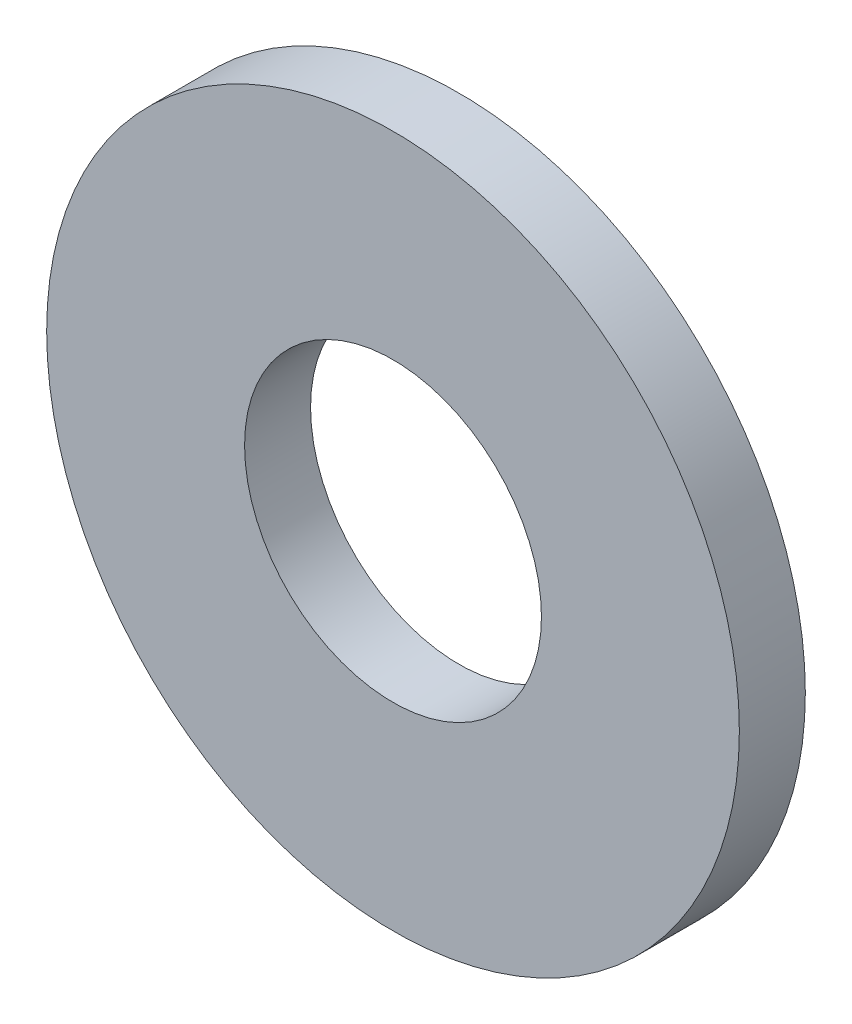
from build123d import *

# Parameters (mm, degrees)
ESQUISSE1_R          = 31.5
ESQUISSE1_R_2        = 13.5
BASE_EXTRUSION_DEPTH = 6


with BuildPart() as part:
    # Esquisse1 → Base-Extrusion (new body)
    with BuildSketch(Plane.XY):
        Circle(ESQUISSE1_R)
        Circle(ESQUISSE1_R_2, mode=Mode.SUBTRACT)
    extrude(amount=-BASE_EXTRUSION_DEPTH)


solid = part.part
